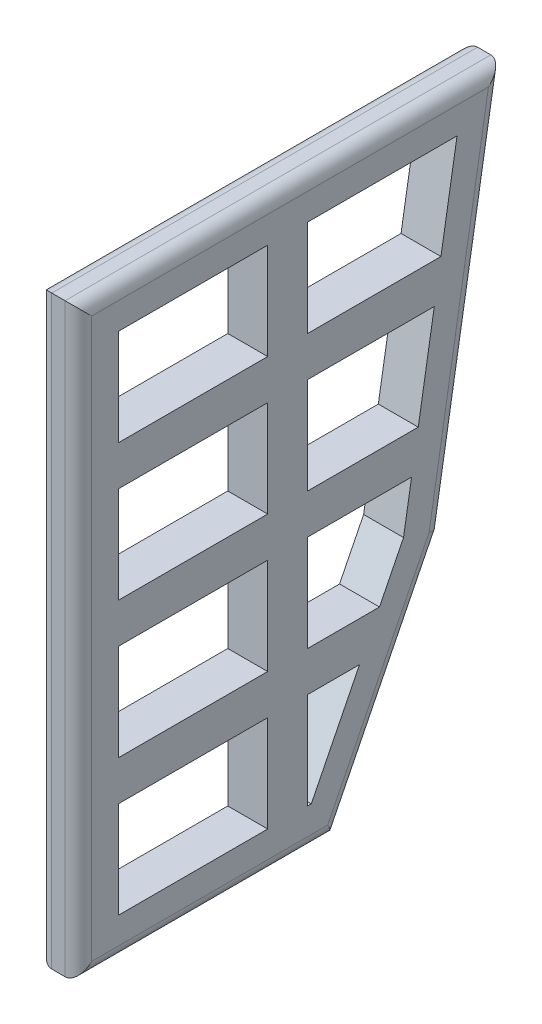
ISO-10303-21;
HEADER;
FILE_DESCRIPTION(('STEP AP214'),'2;1');
FILE_NAME('part.step','',(''),(''),'','','');
FILE_SCHEMA(('AUTOMOTIVE_DESIGN { 1 0 10303 214 1 1 1 1 }'));
ENDSEC;
DATA;
#1=APPLICATION_CONTEXT('core data for automotive mechanical design processes');
#2=APPLICATION_PROTOCOL_DEFINITION('international standard','automotive_design',2000,#1);
#3=PRODUCT_CONTEXT('',#1,'mechanical');
#4=PRODUCT('Part','Part','',(#3));
#5=PRODUCT_RELATED_PRODUCT_CATEGORY('part','',(#4));
#6=PRODUCT_DEFINITION_FORMATION('','',#4);
#7=PRODUCT_DEFINITION_CONTEXT('part definition',#1,'design');
#8=PRODUCT_DEFINITION('design','',#6,#7);
#9=PRODUCT_DEFINITION_SHAPE('','',#8);
#10=(LENGTH_UNIT() NAMED_UNIT(*) SI_UNIT(.MILLI.,.METRE.));
#11=(NAMED_UNIT(*) PLANE_ANGLE_UNIT() SI_UNIT($,.RADIAN.));
#12=(NAMED_UNIT(*) SI_UNIT($,.STERADIAN.) SOLID_ANGLE_UNIT());
#13=UNCERTAINTY_MEASURE_WITH_UNIT(LENGTH_MEASURE(1.E-05),#10,'distance_accuracy_value','');
#14=(GEOMETRIC_REPRESENTATION_CONTEXT(3) GLOBAL_UNCERTAINTY_ASSIGNED_CONTEXT((#13)) GLOBAL_UNIT_ASSIGNED_CONTEXT((#10,
#11,#12)) REPRESENTATION_CONTEXT('',''));
#15=CARTESIAN_POINT('',(0.,0.,0.));
#16=DIRECTION('',(0.,0.,1.));
#17=DIRECTION('',(1.,0.,0.));
#18=AXIS2_PLACEMENT_3D('',#15,#16,#17);
#19=CARTESIAN_POINT('',(0.,65.0875,-4.7625));
#20=DIRECTION('',(0.,0.,1.));
#21=DIRECTION('',(1.,0.,0.));
#22=AXIS2_PLACEMENT_3D('',#19,#20,#21);
#23=PLANE('',#22);
#24=DIRECTION('',(-1.,0.,0.));
#25=VECTOR('',#24,1.);
#26=CARTESIAN_POINT('',(4.7625,16.271875,-4.7625));
#27=LINE('',#26,#25);
#28=CARTESIAN_POINT('',(4.7625,16.271875,-4.7625));
#29=VERTEX_POINT('',#28);
#30=CARTESIAN_POINT('',(0.,16.271875,-4.7625));
#31=VERTEX_POINT('',#30);
#32=EDGE_CURVE('E353',#29,#31,#27,.T.);
#33=ORIENTED_EDGE('',*,*,#32,.F.);
#34=DIRECTION('',(0.,1.,0.));
#35=VECTOR('',#34,1.);
#36=CARTESIAN_POINT('',(4.7625,0.,-4.7625));
#37=LINE('',#36,#35);
#38=CARTESIAN_POINT('',(4.7625,4.7625,-4.7625));
#39=VERTEX_POINT('',#38);
#40=EDGE_CURVE('E503',#39,#29,#37,.T.);
#41=ORIENTED_EDGE('',*,*,#40,.F.);
#42=DIRECTION('',(1.,0.,0.));
#43=VECTOR('',#42,1.);
#44=CARTESIAN_POINT('',(0.,4.7625,-4.7625));
#45=LINE('',#44,#43);
#46=CARTESIAN_POINT('',(0.,4.7625,-4.7625));
#47=VERTEX_POINT('',#46);
#48=EDGE_CURVE('E495',#47,#39,#45,.T.);
#49=ORIENTED_EDGE('',*,*,#48,.F.);
#50=DIRECTION('',(0.,-1.,0.));
#51=VECTOR('',#50,1.);
#52=CARTESIAN_POINT('',(0.,65.0875,-4.7625));
#53=LINE('',#52,#51);
#54=EDGE_CURVE('E472',#31,#47,#53,.T.);
#55=ORIENTED_EDGE('',*,*,#54,.F.);
#56=EDGE_LOOP('',(#33,#41,#49,#55));
#57=FACE_BOUND('',#56,.T.);
#58=ADVANCED_FACE('F33',(#57),#23,.F.);
#59=DIRECTION('',(1.,0.,0.));
#60=VECTOR('',#59,1.);
#61=CARTESIAN_POINT('',(4.7625,21.034375,-4.7625));
#62=LINE('',#61,#60);
#63=CARTESIAN_POINT('',(0.,21.034375,-4.7625));
#64=VERTEX_POINT('',#63);
#65=CARTESIAN_POINT('',(4.7625,21.034375,-4.7625));
#66=VERTEX_POINT('',#65);
#67=EDGE_CURVE('E335',#64,#66,#62,.T.);
#68=ORIENTED_EDGE('',*,*,#67,.F.);
#69=CARTESIAN_POINT('',(0.,32.54375,-4.7625));
#70=VERTEX_POINT('',#69);
#71=EDGE_CURVE('E479',#70,#64,#53,.T.);
#72=ORIENTED_EDGE('',*,*,#71,.F.);
#73=DIRECTION('',(-1.,0.,0.));
#74=VECTOR('',#73,1.);
#75=CARTESIAN_POINT('',(4.7625,32.54375,-4.7625));
#76=LINE('',#75,#74);
#77=CARTESIAN_POINT('',(4.7625,32.54375,-4.7625));
#78=VERTEX_POINT('',#77);
#79=EDGE_CURVE('E412',#78,#70,#76,.T.);
#80=ORIENTED_EDGE('',*,*,#79,.F.);
#81=EDGE_CURVE('E507',#66,#78,#37,.T.);
#82=ORIENTED_EDGE('',*,*,#81,.F.);
#83=EDGE_LOOP('',(#68,#72,#80,#82));
#84=FACE_BOUND('',#83,.T.);
#85=ADVANCED_FACE('F675',(#84),#23,.F.);
#86=CARTESIAN_POINT('',(4.7625,-1.97269209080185,-22.5891441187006));
#87=DIRECTION('',(0.,0.,-1.));
#88=DIRECTION('',(-1.,0.,0.));
#89=AXIS2_PLACEMENT_3D('',#86,#87,#88);
#90=PLANE('',#89);
#91=DIRECTION('',(1.,0.,0.));
#92=VECTOR('',#91,1.);
#93=CARTESIAN_POINT('',(4.7625,16.271875,-22.5891441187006));
#94=LINE('',#93,#92);
#95=CARTESIAN_POINT('',(0.,16.271875,-22.5891441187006));
#96=VERTEX_POINT('',#95);
#97=CARTESIAN_POINT('',(4.7625,16.271875,-22.5891441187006));
#98=VERTEX_POINT('',#97);
#99=EDGE_CURVE('E364',#96,#98,#94,.T.);
#100=ORIENTED_EDGE('',*,*,#99,.F.);
#101=DIRECTION('',(0.,1.,0.));
#102=VECTOR('',#101,1.);
#103=CARTESIAN_POINT('',(0.,-1.97269209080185,-22.5891441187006));
#104=LINE('',#103,#102);
#105=CARTESIAN_POINT('',(0.,4.7625,-22.5891441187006));
#106=VERTEX_POINT('',#105);
#107=EDGE_CURVE('E456',#106,#96,#104,.T.);
#108=ORIENTED_EDGE('',*,*,#107,.F.);
#109=DIRECTION('',(-1.,0.,0.));
#110=VECTOR('',#109,1.);
#111=CARTESIAN_POINT('',(4.7625,4.7625,-22.5891441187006));
#112=LINE('',#111,#110);
#113=CARTESIAN_POINT('',(4.7625,4.7625,-22.5891441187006));
#114=VERTEX_POINT('',#113);
#115=EDGE_CURVE('E449',#114,#106,#112,.T.);
#116=ORIENTED_EDGE('',*,*,#115,.F.);
#117=DIRECTION('',(0.,1.,0.));
#118=VECTOR('',#117,1.);
#119=CARTESIAN_POINT('',(4.7625,-1.97269209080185,-22.5891441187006));
#120=LINE('',#119,#118);
#121=EDGE_CURVE('E448',#114,#98,#120,.T.);
#122=ORIENTED_EDGE('',*,*,#121,.T.);
#123=EDGE_LOOP('',(#100,#108,#116,#122));
#124=FACE_BOUND('',#123,.T.);
#125=ADVANCED_FACE('F682',(#124),#90,.F.);
#126=DIRECTION('',(-1.,0.,0.));
#127=VECTOR('',#126,1.);
#128=CARTESIAN_POINT('',(4.7625,21.034375,-22.5891441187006));
#129=LINE('',#128,#127);
#130=CARTESIAN_POINT('',(4.7625,21.034375,-22.5891441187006));
#131=VERTEX_POINT('',#130);
#132=CARTESIAN_POINT('',(0.,21.034375,-22.5891441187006));
#133=VERTEX_POINT('',#132);
#134=EDGE_CURVE('E59',#131,#133,#129,.T.);
#135=ORIENTED_EDGE('',*,*,#134,.F.);
#136=CARTESIAN_POINT('',(4.7625,32.54375,-22.5891441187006));
#137=VERTEX_POINT('',#136);
#138=EDGE_CURVE('E454',#131,#137,#120,.T.);
#139=ORIENTED_EDGE('',*,*,#138,.T.);
#140=DIRECTION('',(1.,0.,0.));
#141=VECTOR('',#140,1.);
#142=CARTESIAN_POINT('',(4.7625,32.54375,-22.5891441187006));
#143=LINE('',#142,#141);
#144=CARTESIAN_POINT('',(0.,32.54375,-22.5891441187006));
#145=VERTEX_POINT('',#144);
#146=EDGE_CURVE('E435',#145,#137,#143,.T.);
#147=ORIENTED_EDGE('',*,*,#146,.F.);
#148=EDGE_CURVE('E460',#133,#145,#104,.T.);
#149=ORIENTED_EDGE('',*,*,#148,.F.);
#150=EDGE_LOOP('',(#135,#139,#147,#149));
#151=FACE_BOUND('',#150,.T.);
#152=ADVANCED_FACE('F698',(#151),#90,.F.);
#153=CARTESIAN_POINT('',(4.7625,-1.97269209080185,-27.3516441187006));
#154=DIRECTION('',(0.,0.,1.));
#155=DIRECTION('',(1.,0.,0.));
#156=AXIS2_PLACEMENT_3D('',#153,#154,#155);
#157=PLANE('',#156);
#158=DIRECTION('',(-1.,0.,0.));
#159=VECTOR('',#158,1.);
#160=CARTESIAN_POINT('',(4.7625,16.271875,-27.3516441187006));
#161=LINE('',#160,#159);
#162=CARTESIAN_POINT('',(4.7625,16.271875,-27.3516441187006));
#163=VERTEX_POINT('',#162);
#164=CARTESIAN_POINT('',(0.,16.271875,-27.3516441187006));
#165=VERTEX_POINT('',#164);
#166=EDGE_CURVE('E51',#163,#165,#161,.T.);
#167=ORIENTED_EDGE('',*,*,#166,.F.);
#168=DIRECTION('',(0.,1.,0.));
#169=VECTOR('',#168,1.);
#170=CARTESIAN_POINT('',(4.7625,-1.97269209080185,-27.3516441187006));
#171=LINE('',#170,#169);
#172=CARTESIAN_POINT('',(4.7625,4.7625,-27.3516441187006));
#173=VERTEX_POINT('',#172);
#174=EDGE_CURVE('E464',#173,#163,#171,.T.);
#175=ORIENTED_EDGE('',*,*,#174,.F.);
#176=DIRECTION('',(1.,0.,0.));
#177=VECTOR('',#176,1.);
#178=CARTESIAN_POINT('',(4.7625,4.7625,-27.3516441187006));
#179=LINE('',#178,#177);
#180=CARTESIAN_POINT('',(0.,4.7625,-27.3516441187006));
#181=VERTEX_POINT('',#180);
#182=EDGE_CURVE('E442',#181,#173,#179,.T.);
#183=ORIENTED_EDGE('',*,*,#182,.F.);
#184=DIRECTION('',(0.,1.,0.));
#185=VECTOR('',#184,1.);
#186=CARTESIAN_POINT('',(0.,-1.97269209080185,-27.3516441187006));
#187=LINE('',#186,#185);
#188=EDGE_CURVE('E443',#181,#165,#187,.T.);
#189=ORIENTED_EDGE('',*,*,#188,.T.);
#190=EDGE_LOOP('',(#167,#175,#183,#189));
#191=FACE_BOUND('',#190,.T.);
#192=ADVANCED_FACE('F931',(#191),#157,.F.);
#193=DIRECTION('',(1.,0.,0.));
#194=VECTOR('',#193,1.);
#195=CARTESIAN_POINT('',(4.7625,21.034375,-27.3516441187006));
#196=LINE('',#195,#194);
#197=CARTESIAN_POINT('',(0.,21.034375,-27.3516441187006));
#198=VERTEX_POINT('',#197);
#199=CARTESIAN_POINT('',(4.7625,21.034375,-27.3516441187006));
#200=VERTEX_POINT('',#199);
#201=EDGE_CURVE('E344',#198,#200,#196,.T.);
#202=ORIENTED_EDGE('',*,*,#201,.F.);
#203=CARTESIAN_POINT('',(0.,32.54375,-27.3516441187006));
#204=VERTEX_POINT('',#203);
#205=EDGE_CURVE('E332',#198,#204,#187,.T.);
#206=ORIENTED_EDGE('',*,*,#205,.T.);
#207=DIRECTION('',(-1.,0.,0.));
#208=VECTOR('',#207,1.);
#209=CARTESIAN_POINT('',(4.7625,32.54375,-27.3516441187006));
#210=LINE('',#209,#208);
#211=CARTESIAN_POINT('',(4.7625,32.54375,-27.3516441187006));
#212=VERTEX_POINT('',#211);
#213=EDGE_CURVE('E11',#212,#204,#210,.T.);
#214=ORIENTED_EDGE('',*,*,#213,.F.);
#215=EDGE_CURVE('E467',#200,#212,#171,.T.);
#216=ORIENTED_EDGE('',*,*,#215,.F.);
#217=EDGE_LOOP('',(#202,#206,#214,#216));
#218=FACE_BOUND('',#217,.T.);
#219=ADVANCED_FACE('F939',(#218),#157,.F.);
#220=CARTESIAN_POINT('',(0.,4.7625,-27.7903230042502));
#221=DIRECTION('',(0.,-0.447134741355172,-0.894466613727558));
#222=DIRECTION('',(0.,0.894466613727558,-0.447134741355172));
#223=AXIS2_PLACEMENT_3D('',#220,#221,#222);
#224=PLANE('',#223);
#225=DIRECTION('',(-1.,0.,0.));
#226=VECTOR('',#225,1.);
#227=CARTESIAN_POINT('',(4.7625,16.271875,-33.5437422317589));
#228=LINE('',#227,#226);
#229=CARTESIAN_POINT('',(4.7625,16.271875,-33.5437422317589));
#230=VERTEX_POINT('',#229);
#231=CARTESIAN_POINT('',(0.,16.271875,-33.5437422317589));
#232=VERTEX_POINT('',#231);
#233=EDGE_CURVE('E342',#230,#232,#228,.T.);
#234=ORIENTED_EDGE('',*,*,#233,.T.);
#235=DIRECTION('',(0.,0.894466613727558,-0.447134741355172));
#236=VECTOR('',#235,1.);
#237=CARTESIAN_POINT('',(0.,4.7625,-27.7903230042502));
#238=LINE('',#237,#236);
#239=CARTESIAN_POINT('',(0.,4.7625,-27.7903230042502));
#240=VERTEX_POINT('',#239);
#241=EDGE_CURVE('E323',#240,#232,#238,.T.);
#242=ORIENTED_EDGE('',*,*,#241,.F.);
#243=DIRECTION('',(1.,0.,0.));
#244=VECTOR('',#243,1.);
#245=CARTESIAN_POINT('',(0.,4.7625,-27.7903230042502));
#246=LINE('',#245,#244);
#247=CARTESIAN_POINT('',(4.7625,4.7625,-27.7903230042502));
#248=VERTEX_POINT('',#247);
#249=EDGE_CURVE('E492',#240,#248,#246,.T.);
#250=ORIENTED_EDGE('',*,*,#249,.T.);
#251=DIRECTION('',(0.,-0.894466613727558,0.447134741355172));
#252=VECTOR('',#251,1.);
#253=CARTESIAN_POINT('',(4.7625,-10.1624949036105,-20.3294702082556));
#254=LINE('',#253,#252);
#255=EDGE_CURVE('E37',#230,#248,#254,.T.);
#256=ORIENTED_EDGE('',*,*,#255,.F.);
#257=EDGE_LOOP('',(#234,#242,#250,#256));
#258=FACE_BOUND('',#257,.T.);
#259=ADVANCED_FACE('F946',(#258),#224,.F.);
#260=DIRECTION('',(1.,0.,0.));
#261=VECTOR('',#260,1.);
#262=CARTESIAN_POINT('',(4.7625,21.034375,-35.9244674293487));
#263=LINE('',#262,#261);
#264=CARTESIAN_POINT('',(0.,21.034375,-35.9244674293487));
#265=VERTEX_POINT('',#264);
#266=CARTESIAN_POINT('',(4.7625,21.034375,-35.9244674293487));
#267=VERTEX_POINT('',#266);
#268=EDGE_CURVE('E316',#265,#267,#263,.T.);
#269=ORIENTED_EDGE('',*,*,#268,.T.);
#270=CARTESIAN_POINT('',(4.7625,26.7759606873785,-38.794627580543));
#271=VERTEX_POINT('',#270);
#272=EDGE_CURVE('E512',#271,#267,#254,.T.);
#273=ORIENTED_EDGE('',*,*,#272,.F.);
#274=DIRECTION('',(1.,0.,0.));
#275=VECTOR('',#274,1.);
#276=CARTESIAN_POINT('',(0.,26.7759606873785,-38.794627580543));
#277=LINE('',#276,#275);
#278=CARTESIAN_POINT('',(0.,26.7759606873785,-38.794627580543));
#279=VERTEX_POINT('',#278);
#280=EDGE_CURVE('E319',#279,#271,#277,.T.);
#281=ORIENTED_EDGE('',*,*,#280,.F.);
#282=EDGE_CURVE('E311',#265,#279,#238,.T.);
#283=ORIENTED_EDGE('',*,*,#282,.F.);
#284=EDGE_LOOP('',(#269,#273,#281,#283));
#285=FACE_BOUND('',#284,.T.);
#286=ADVANCED_FACE('F313',(#285),#224,.F.);
#287=CARTESIAN_POINT('',(0.,26.7759606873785,-38.794627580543));
#288=DIRECTION('',(0.,-0.164359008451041,-0.986400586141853));
#289=DIRECTION('',(0.,0.986400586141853,-0.164359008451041));
#290=AXIS2_PLACEMENT_3D('',#287,#288,#289);
#291=PLANE('',#290);
#292=DIRECTION('',(-1.,0.,0.));
#293=VECTOR('',#292,1.);
#294=CARTESIAN_POINT('',(4.76249999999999,48.815625,-42.4669868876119));
#295=LINE('',#294,#293);
#296=CARTESIAN_POINT('',(4.76249999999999,48.815625,-42.4669868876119));
#297=VERTEX_POINT('',#296);
#298=CARTESIAN_POINT('',(0.,48.815625,-42.4669868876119));
#299=VERTEX_POINT('',#298);
#300=EDGE_CURVE('E377',#297,#299,#295,.T.);
#301=ORIENTED_EDGE('',*,*,#300,.T.);
#302=DIRECTION('',(0.,0.986400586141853,-0.164359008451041));
#303=VECTOR('',#302,1.);
#304=CARTESIAN_POINT('',(0.,26.7759606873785,-38.794627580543));
#305=LINE('',#304,#303);
#306=CARTESIAN_POINT('',(0.,37.30625,-40.5492371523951));
#307=VERTEX_POINT('',#306);
#308=EDGE_CURVE('E487',#307,#299,#305,.T.);
#309=ORIENTED_EDGE('',*,*,#308,.F.);
#310=DIRECTION('',(1.,0.,0.));
#311=VECTOR('',#310,1.);
#312=CARTESIAN_POINT('',(4.7625,37.30625,-40.5492371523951));
#313=LINE('',#312,#311);
#314=CARTESIAN_POINT('',(4.7625,37.30625,-40.5492371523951));
#315=VERTEX_POINT('',#314);
#316=EDGE_CURVE('E410',#307,#315,#313,.T.);
#317=ORIENTED_EDGE('',*,*,#316,.T.);
#318=DIRECTION('',(0.,-0.986400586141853,0.164359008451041));
#319=VECTOR('',#318,1.);
#320=CARTESIAN_POINT('',(4.7625,-5.56621062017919,-33.4056129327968));
#321=LINE('',#320,#319);
#322=EDGE_CURVE('E521',#297,#315,#321,.T.);
#323=ORIENTED_EDGE('',*,*,#322,.F.);
#324=EDGE_LOOP('',(#301,#309,#317,#323));
#325=FACE_BOUND('',#324,.T.);
#326=ADVANCED_FACE('F539',(#325),#291,.F.);
#327=DIRECTION('',(1.,0.,0.));
#328=VECTOR('',#327,1.);
#329=CARTESIAN_POINT('',(4.76249999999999,53.578125,-43.2605385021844));
#330=LINE('',#329,#328);
#331=CARTESIAN_POINT('',(0.,53.578125,-43.2605385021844));
#332=VERTEX_POINT('',#331);
#333=CARTESIAN_POINT('',(4.76249999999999,53.578125,-43.2605385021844));
#334=VERTEX_POINT('',#333);
#335=EDGE_CURVE('E371',#332,#334,#330,.T.);
#336=ORIENTED_EDGE('',*,*,#335,.T.);
#337=CARTESIAN_POINT('',(4.7625,65.0875,-45.1782882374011));
#338=VERTEX_POINT('',#337);
#339=EDGE_CURVE('E516',#338,#334,#321,.T.);
#340=ORIENTED_EDGE('',*,*,#339,.F.);
#341=DIRECTION('',(1.,0.,0.));
#342=VECTOR('',#341,1.);
#343=CARTESIAN_POINT('',(0.,65.0875,-45.1782882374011));
#344=LINE('',#343,#342);
#345=CARTESIAN_POINT('',(0.,65.0875,-45.1782882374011));
#346=VERTEX_POINT('',#345);
#347=EDGE_CURVE('E488',#346,#338,#344,.T.);
#348=ORIENTED_EDGE('',*,*,#347,.F.);
#349=EDGE_CURVE('E483',#332,#346,#305,.T.);
#350=ORIENTED_EDGE('',*,*,#349,.F.);
#351=EDGE_LOOP('',(#336,#340,#348,#350));
#352=FACE_BOUND('',#351,.T.);
#353=ADVANCED_FACE('F643',(#352),#291,.F.);
#354=DIRECTION('',(-1.,0.,0.));
#355=VECTOR('',#354,1.);
#356=CARTESIAN_POINT('',(4.76249999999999,48.815625,-4.7625));
#357=LINE('',#356,#355);
#358=CARTESIAN_POINT('',(4.76249999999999,48.815625,-4.7625));
#359=VERTEX_POINT('',#358);
#360=CARTESIAN_POINT('',(0.,48.815625,-4.7625));
#361=VERTEX_POINT('',#360);
#362=EDGE_CURVE('E373',#359,#361,#357,.T.);
#363=ORIENTED_EDGE('',*,*,#362,.F.);
#364=CARTESIAN_POINT('',(4.7625,37.30625,-4.7625));
#365=VERTEX_POINT('',#364);
#366=EDGE_CURVE('E508',#365,#359,#37,.T.);
#367=ORIENTED_EDGE('',*,*,#366,.F.);
#368=DIRECTION('',(1.,0.,0.));
#369=VECTOR('',#368,1.);
#370=CARTESIAN_POINT('',(4.7625,37.30625,-4.7625));
#371=LINE('',#370,#369);
#372=CARTESIAN_POINT('',(0.,37.30625,-4.7625));
#373=VERTEX_POINT('',#372);
#374=EDGE_CURVE('E407',#373,#365,#371,.T.);
#375=ORIENTED_EDGE('',*,*,#374,.F.);
#376=EDGE_CURVE('E478',#361,#373,#53,.T.);
#377=ORIENTED_EDGE('',*,*,#376,.F.);
#378=EDGE_LOOP('',(#363,#367,#375,#377));
#379=FACE_BOUND('',#378,.T.);
#380=ADVANCED_FACE('F684',(#379),#23,.F.);
#381=DIRECTION('',(1.,0.,0.));
#382=VECTOR('',#381,1.);
#383=CARTESIAN_POINT('',(4.76249999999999,53.578125,-4.7625));
#384=LINE('',#383,#382);
#385=CARTESIAN_POINT('',(0.,53.578125,-4.7625));
#386=VERTEX_POINT('',#385);
#387=CARTESIAN_POINT('',(4.76249999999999,53.578125,-4.7625));
#388=VERTEX_POINT('',#387);
#389=EDGE_CURVE('E368',#386,#388,#384,.T.);
#390=ORIENTED_EDGE('',*,*,#389,.F.);
#391=CARTESIAN_POINT('',(0.,65.0875,-4.7625));
#392=VERTEX_POINT('',#391);
#393=EDGE_CURVE('E474',#392,#386,#53,.T.);
#394=ORIENTED_EDGE('',*,*,#393,.F.);
#395=DIRECTION('',(1.,0.,0.));
#396=VECTOR('',#395,1.);
#397=CARTESIAN_POINT('',(0.,65.0875,-4.7625));
#398=LINE('',#397,#396);
#399=CARTESIAN_POINT('',(4.7625,65.0875,-4.7625));
#400=VERTEX_POINT('',#399);
#401=EDGE_CURVE('E486',#392,#400,#398,.T.);
#402=ORIENTED_EDGE('',*,*,#401,.T.);
#403=EDGE_CURVE('E491',#388,#400,#37,.T.);
#404=ORIENTED_EDGE('',*,*,#403,.F.);
#405=EDGE_LOOP('',(#390,#394,#402,#404));
#406=FACE_BOUND('',#405,.T.);
#407=ADVANCED_FACE('F678',(#406),#23,.F.);
#408=DIRECTION('',(1.,0.,0.));
#409=VECTOR('',#408,1.);
#410=CARTESIAN_POINT('',(4.7625,48.815625,-22.5891441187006));
#411=LINE('',#410,#409);
#412=CARTESIAN_POINT('',(0.,48.815625,-22.5891441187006));
#413=VERTEX_POINT('',#412);
#414=CARTESIAN_POINT('',(4.7625,48.815625,-22.5891441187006));
#415=VERTEX_POINT('',#414);
#416=EDGE_CURVE('E403',#413,#415,#411,.T.);
#417=ORIENTED_EDGE('',*,*,#416,.F.);
#418=CARTESIAN_POINT('',(0.,37.30625,-22.5891441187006));
#419=VERTEX_POINT('',#418);
#420=EDGE_CURVE('E461',#419,#413,#104,.T.);
#421=ORIENTED_EDGE('',*,*,#420,.F.);
#422=DIRECTION('',(-1.,0.,0.));
#423=VECTOR('',#422,1.);
#424=CARTESIAN_POINT('',(4.7625,37.30625,-22.5891441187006));
#425=LINE('',#424,#423);
#426=CARTESIAN_POINT('',(4.7625,37.30625,-22.5891441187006));
#427=VERTEX_POINT('',#426);
#428=EDGE_CURVE('E419',#427,#419,#425,.T.);
#429=ORIENTED_EDGE('',*,*,#428,.F.);
#430=EDGE_CURVE('E455',#427,#415,#120,.T.);
#431=ORIENTED_EDGE('',*,*,#430,.T.);
#432=EDGE_LOOP('',(#417,#421,#429,#431));
#433=FACE_BOUND('',#432,.T.);
#434=ADVANCED_FACE('F689',(#433),#90,.F.);
#435=DIRECTION('',(-1.,0.,0.));
#436=VECTOR('',#435,1.);
#437=CARTESIAN_POINT('',(4.7625,53.578125,-22.5891441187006));
#438=LINE('',#437,#436);
#439=CARTESIAN_POINT('',(4.7625,53.578125,-22.5891441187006));
#440=VERTEX_POINT('',#439);
#441=CARTESIAN_POINT('',(0.,53.578125,-22.5891441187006));
#442=VERTEX_POINT('',#441);
#443=EDGE_CURVE('E397',#440,#442,#438,.T.);
#444=ORIENTED_EDGE('',*,*,#443,.F.);
#445=CARTESIAN_POINT('',(4.7625,65.0875,-22.5891441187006));
#446=VERTEX_POINT('',#445);
#447=EDGE_CURVE('E466',#440,#446,#120,.T.);
#448=ORIENTED_EDGE('',*,*,#447,.T.);
#449=DIRECTION('',(-1.,0.,0.));
#450=VECTOR('',#449,1.);
#451=CARTESIAN_POINT('',(4.7625,65.0875,-22.5891441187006));
#452=LINE('',#451,#450);
#453=CARTESIAN_POINT('',(0.,65.0875,-22.5891441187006));
#454=VERTEX_POINT('',#453);
#455=EDGE_CURVE('E444',#446,#454,#452,.T.);
#456=ORIENTED_EDGE('',*,*,#455,.T.);
#457=EDGE_CURVE('E447',#442,#454,#104,.T.);
#458=ORIENTED_EDGE('',*,*,#457,.F.);
#459=EDGE_LOOP('',(#444,#448,#456,#458));
#460=FACE_BOUND('',#459,.T.);
#461=ADVANCED_FACE('F695',(#460),#90,.F.);
#462=DIRECTION('',(-1.,0.,0.));
#463=VECTOR('',#462,1.);
#464=CARTESIAN_POINT('',(4.7625,48.815625,-27.3516441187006));
#465=LINE('',#464,#463);
#466=CARTESIAN_POINT('',(4.7625,48.815625,-27.3516441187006));
#467=VERTEX_POINT('',#466);
#468=CARTESIAN_POINT('',(0.,48.815625,-27.3516441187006));
#469=VERTEX_POINT('',#468);
#470=EDGE_CURVE('E400',#467,#469,#465,.T.);
#471=ORIENTED_EDGE('',*,*,#470,.F.);
#472=CARTESIAN_POINT('',(4.7625,37.30625,-27.3516441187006));
#473=VERTEX_POINT('',#472);
#474=EDGE_CURVE('E468',#473,#467,#171,.T.);
#475=ORIENTED_EDGE('',*,*,#474,.F.);
#476=DIRECTION('',(1.,0.,0.));
#477=VECTOR('',#476,1.);
#478=CARTESIAN_POINT('',(4.7625,37.30625,-27.3516441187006));
#479=LINE('',#478,#477);
#480=CARTESIAN_POINT('',(0.,37.30625,-27.3516441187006));
#481=VERTEX_POINT('',#480);
#482=EDGE_CURVE('E43',#481,#473,#479,.T.);
#483=ORIENTED_EDGE('',*,*,#482,.F.);
#484=EDGE_CURVE('E463',#481,#469,#187,.T.);
#485=ORIENTED_EDGE('',*,*,#484,.T.);
#486=EDGE_LOOP('',(#471,#475,#483,#485));
#487=FACE_BOUND('',#486,.T.);
#488=ADVANCED_FACE('F935',(#487),#157,.F.);
#489=DIRECTION('',(1.,0.,0.));
#490=VECTOR('',#489,1.);
#491=CARTESIAN_POINT('',(4.7625,53.578125,-27.3516441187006));
#492=LINE('',#491,#490);
#493=CARTESIAN_POINT('',(0.,53.578125,-27.3516441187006));
#494=VERTEX_POINT('',#493);
#495=CARTESIAN_POINT('',(4.76249999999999,53.578125,-27.3516441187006));
#496=VERTEX_POINT('',#495);
#497=EDGE_CURVE('E380',#494,#496,#492,.T.);
#498=ORIENTED_EDGE('',*,*,#497,.F.);
#499=CARTESIAN_POINT('',(0.,65.0875,-27.3516441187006));
#500=VERTEX_POINT('',#499);
#501=EDGE_CURVE('E459',#494,#500,#187,.T.);
#502=ORIENTED_EDGE('',*,*,#501,.T.);
#503=DIRECTION('',(1.,0.,0.));
#504=VECTOR('',#503,1.);
#505=CARTESIAN_POINT('',(4.7625,65.0875,-27.3516441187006));
#506=LINE('',#505,#504);
#507=CARTESIAN_POINT('',(4.7625,65.0875,-27.3516441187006));
#508=VERTEX_POINT('',#507);
#509=EDGE_CURVE('E439',#500,#508,#506,.T.);
#510=ORIENTED_EDGE('',*,*,#509,.T.);
#511=EDGE_CURVE('E438',#496,#508,#171,.T.);
#512=ORIENTED_EDGE('',*,*,#511,.F.);
#513=EDGE_LOOP('',(#498,#502,#510,#512));
#514=FACE_BOUND('',#513,.T.);
#515=ADVANCED_FACE('F653',(#514),#157,.F.);
#516=DIRECTION('',(-1.,0.,0.));
#517=VECTOR('',#516,1.);
#518=CARTESIAN_POINT('',(4.7625,32.54375,-39.7556855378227));
#519=LINE('',#518,#517);
#520=CARTESIAN_POINT('',(4.7625,32.54375,-39.7556855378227));
#521=VERTEX_POINT('',#520);
#522=CARTESIAN_POINT('',(0.,32.54375,-39.7556855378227));
#523=VERTEX_POINT('',#522);
#524=EDGE_CURVE('E417',#521,#523,#519,.T.);
#525=ORIENTED_EDGE('',*,*,#524,.T.);
#526=EDGE_CURVE('E484',#279,#523,#305,.T.);
#527=ORIENTED_EDGE('',*,*,#526,.F.);
#528=ORIENTED_EDGE('',*,*,#280,.T.);
#529=EDGE_CURVE('E513',#521,#271,#321,.T.);
#530=ORIENTED_EDGE('',*,*,#529,.F.);
#531=EDGE_LOOP('',(#525,#527,#528,#530));
#532=FACE_BOUND('',#531,.T.);
#533=ADVANCED_FACE('F943',(#532),#291,.F.);
#534=CARTESIAN_POINT('',(0.,65.0875,-45.1782882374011));
#535=DIRECTION('',(0.,1.,0.));
#536=DIRECTION('',(0.,0.,1.));
#537=AXIS2_PLACEMENT_3D('',#534,#535,#536);
#538=PLANE('',#537);
#539=ORIENTED_EDGE('',*,*,#455,.F.);
#540=DIRECTION('',(0.,0.,-1.));
#541=VECTOR('',#540,1.);
#542=CARTESIAN_POINT('',(4.7625,65.0875,0.));
#543=LINE('',#542,#541);
#544=EDGE_CURVE('E524',#400,#446,#543,.T.);
#545=ORIENTED_EDGE('',*,*,#544,.F.);
#546=ORIENTED_EDGE('',*,*,#401,.F.);
#547=DIRECTION('',(0.,0.,1.));
#548=VECTOR('',#547,1.);
#549=CARTESIAN_POINT('',(0.,65.0875,-45.1782882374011));
#550=LINE('',#549,#548);
#551=EDGE_CURVE('E473',#454,#392,#550,.T.);
#552=ORIENTED_EDGE('',*,*,#551,.F.);
#553=EDGE_LOOP('',(#539,#545,#546,#552));
#554=FACE_BOUND('',#553,.T.);
#555=ADVANCED_FACE('F710',(#554),#538,.F.);
#556=ORIENTED_EDGE('',*,*,#509,.F.);
#557=EDGE_CURVE('E469',#346,#500,#550,.T.);
#558=ORIENTED_EDGE('',*,*,#557,.F.);
#559=ORIENTED_EDGE('',*,*,#347,.T.);
#560=EDGE_CURVE('E520',#508,#338,#543,.T.);
#561=ORIENTED_EDGE('',*,*,#560,.F.);
#562=EDGE_LOOP('',(#556,#558,#559,#561));
#563=FACE_BOUND('',#562,.T.);
#564=ADVANCED_FACE('F646',(#563),#538,.F.);
#565=CARTESIAN_POINT('',(0.,4.7625,-4.7625));
#566=DIRECTION('',(0.,-1.,0.));
#567=DIRECTION('',(0.,0.,-1.));
#568=AXIS2_PLACEMENT_3D('',#565,#566,#567);
#569=PLANE('',#568);
#570=ORIENTED_EDGE('',*,*,#115,.T.);
#571=DIRECTION('',(0.,0.,-1.));
#572=VECTOR('',#571,1.);
#573=CARTESIAN_POINT('',(0.,4.7625,-4.7625));
#574=LINE('',#573,#572);
#575=EDGE_CURVE('E324',#47,#106,#574,.T.);
#576=ORIENTED_EDGE('',*,*,#575,.F.);
#577=ORIENTED_EDGE('',*,*,#48,.T.);
#578=DIRECTION('',(0.,0.,1.));
#579=VECTOR('',#578,1.);
#580=CARTESIAN_POINT('',(4.7625,4.7625,0.));
#581=LINE('',#580,#579);
#582=EDGE_CURVE('E506',#114,#39,#581,.T.);
#583=ORIENTED_EDGE('',*,*,#582,.F.);
#584=EDGE_LOOP('',(#570,#576,#577,#583));
#585=FACE_BOUND('',#584,.T.);
#586=ADVANCED_FACE('F922',(#585),#569,.F.);
#587=ORIENTED_EDGE('',*,*,#182,.T.);
#588=EDGE_CURVE('E509',#248,#173,#581,.T.);
#589=ORIENTED_EDGE('',*,*,#588,.F.);
#590=ORIENTED_EDGE('',*,*,#249,.F.);
#591=EDGE_CURVE('E477',#181,#240,#574,.T.);
#592=ORIENTED_EDGE('',*,*,#591,.F.);
#593=EDGE_LOOP('',(#587,#589,#590,#592));
#594=FACE_BOUND('',#593,.T.);
#595=ADVANCED_FACE('F771',(#594),#569,.F.);
#596=CARTESIAN_POINT('',(4.7625,0.,-30.734));
#597=DIRECTION('',(0.,1.,0.));
#598=DIRECTION('',(0.,0.,1.));
#599=AXIS2_PLACEMENT_3D('',#596,#597,#598);
#600=PLANE('',#599);
#601=DIRECTION('',(-1.,0.,0.));
#602=VECTOR('',#601,1.);
#603=CARTESIAN_POINT('',(4.7625,0.,0.));
#604=LINE('',#603,#602);
#605=CARTESIAN_POINT('',(3.175,0.,0.));
#606=VERTEX_POINT('',#605);
#607=CARTESIAN_POINT('',(1.5875,0.,0.));
#608=VERTEX_POINT('',#607);
#609=EDGE_CURVE('E628',#606,#608,#604,.T.);
#610=ORIENTED_EDGE('',*,*,#609,.T.);
#611=DIRECTION('',(0.,0.,-1.));
#612=VECTOR('',#611,1.);
#613=CARTESIAN_POINT('',(1.5875,0.,-30.734));
#614=LINE('',#613,#612);
#615=CARTESIAN_POINT('',(1.5875,0.,-30.734));
#616=VERTEX_POINT('',#615);
#617=EDGE_CURVE('E592',#608,#616,#614,.T.);
#618=ORIENTED_EDGE('',*,*,#617,.T.);
#619=DIRECTION('',(-1.,0.,0.));
#620=VECTOR('',#619,1.);
#621=CARTESIAN_POINT('',(4.7625,0.,-30.734));
#622=LINE('',#621,#620);
#623=CARTESIAN_POINT('',(3.175,0.,-30.734));
#624=VERTEX_POINT('',#623);
#625=EDGE_CURVE('E617',#624,#616,#622,.T.);
#626=ORIENTED_EDGE('',*,*,#625,.F.);
#627=DIRECTION('',(0.,0.,-1.));
#628=VECTOR('',#627,1.);
#629=CARTESIAN_POINT('',(3.175,0.,-30.734));
#630=LINE('',#629,#628);
#631=EDGE_CURVE('E594',#624,#606,#630,.F.);
#632=ORIENTED_EDGE('',*,*,#631,.T.);
#633=EDGE_LOOP('',(#610,#618,#626,#632));
#634=FACE_BOUND('',#633,.T.);
#635=ADVANCED_FACE('F767',(#634),#600,.F.);
#636=CARTESIAN_POINT('',(4.7625,25.286928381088,-43.3746777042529));
#637=DIRECTION('',(0.,0.447134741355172,0.894466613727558));
#638=DIRECTION('',(0.,-0.894466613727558,0.447134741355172));
#639=AXIS2_PLACEMENT_3D('',#636,#637,#638);
#640=PLANE('',#639);
#641=ORIENTED_EDGE('',*,*,#625,.T.);
#642=DIRECTION('',(0.,0.894466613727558,-0.447134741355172));
#643=VECTOR('',#642,1.);
#644=CARTESIAN_POINT('',(1.5875,25.286928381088,-43.3746777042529));
#645=LINE('',#644,#643);
#646=CARTESIAN_POINT('',(1.5875,25.286928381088,-43.3746777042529));
#647=VERTEX_POINT('',#646);
#648=EDGE_CURVE('E597',#616,#647,#645,.T.);
#649=ORIENTED_EDGE('',*,*,#648,.T.);
#650=DIRECTION('',(-1.,0.,0.));
#651=VECTOR('',#650,1.);
#652=CARTESIAN_POINT('',(4.7625,25.286928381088,-43.3746777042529));
#653=LINE('',#652,#651);
#654=CARTESIAN_POINT('',(3.175,25.286928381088,-43.3746777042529));
#655=VERTEX_POINT('',#654);
#656=EDGE_CURVE('E620',#655,#647,#653,.T.);
#657=ORIENTED_EDGE('',*,*,#656,.F.);
#658=DIRECTION('',(0.,0.894466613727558,-0.447134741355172));
#659=VECTOR('',#658,1.);
#660=CARTESIAN_POINT('',(3.175,25.286928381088,-43.3746777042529));
#661=LINE('',#660,#659);
#662=EDGE_CURVE('E599',#655,#624,#661,.F.);
#663=ORIENTED_EDGE('',*,*,#662,.T.);
#664=EDGE_LOOP('',(#641,#649,#657,#663));
#665=FACE_BOUND('',#664,.T.);
#666=ADVANCED_FACE('F763',(#665),#640,.F.);
#667=CARTESIAN_POINT('',(4.7625,69.85,-50.8));
#668=DIRECTION('',(0.,0.164359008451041,0.986400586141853));
#669=DIRECTION('',(0.,-0.986400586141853,0.164359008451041));
#670=AXIS2_PLACEMENT_3D('',#667,#668,#669);
#671=PLANE('',#670);
#672=ORIENTED_EDGE('',*,*,#656,.T.);
#673=DIRECTION('',(0.,0.986400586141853,-0.164359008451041));
#674=VECTOR('',#673,1.);
#675=CARTESIAN_POINT('',(1.5875,69.85,-50.8));
#676=LINE('',#675,#674);
#677=CARTESIAN_POINT('',(1.5875,69.85,-50.8));
#678=VERTEX_POINT('',#677);
#679=EDGE_CURVE('E612',#647,#678,#676,.T.);
#680=ORIENTED_EDGE('',*,*,#679,.T.);
#681=DIRECTION('',(-1.,0.,0.));
#682=VECTOR('',#681,1.);
#683=CARTESIAN_POINT('',(4.7625,69.85,-50.8));
#684=LINE('',#683,#682);
#685=CARTESIAN_POINT('',(3.175,69.85,-50.8));
#686=VERTEX_POINT('',#685);
#687=EDGE_CURVE('E623',#686,#678,#684,.T.);
#688=ORIENTED_EDGE('',*,*,#687,.F.);
#689=DIRECTION('',(0.,0.986400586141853,-0.164359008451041));
#690=VECTOR('',#689,1.);
#691=CARTESIAN_POINT('',(3.175,69.85,-50.8));
#692=LINE('',#691,#690);
#693=EDGE_CURVE('E615',#686,#655,#692,.F.);
#694=ORIENTED_EDGE('',*,*,#693,.T.);
#695=EDGE_LOOP('',(#672,#680,#688,#694));
#696=FACE_BOUND('',#695,.T.);
#697=ADVANCED_FACE('F759',(#696),#671,.F.);
#698=CARTESIAN_POINT('',(4.7625,69.85,0.));
#699=DIRECTION('',(0.,-1.,0.));
#700=DIRECTION('',(0.,0.,-1.));
#701=AXIS2_PLACEMENT_3D('',#698,#699,#700);
#702=PLANE('',#701);
#703=DIRECTION('',(-1.,0.,0.));
#704=VECTOR('',#703,1.);
#705=CARTESIAN_POINT('',(4.7625,69.85,0.));
#706=LINE('',#705,#704);
#707=CARTESIAN_POINT('',(3.175,69.85,0.));
#708=VERTEX_POINT('',#707);
#709=CARTESIAN_POINT('',(1.5875,69.85,0.));
#710=VERTEX_POINT('',#709);
#711=EDGE_CURVE('E626',#708,#710,#706,.T.);
#712=ORIENTED_EDGE('',*,*,#711,.F.);
#713=DIRECTION('',(0.,0.,1.));
#714=VECTOR('',#713,1.);
#715=CARTESIAN_POINT('',(3.175,69.85,0.));
#716=LINE('',#715,#714);
#717=EDGE_CURVE('E577',#708,#686,#716,.F.);
#718=ORIENTED_EDGE('',*,*,#717,.T.);
#719=ORIENTED_EDGE('',*,*,#687,.T.);
#720=DIRECTION('',(0.,0.,1.));
#721=VECTOR('',#720,1.);
#722=CARTESIAN_POINT('',(1.5875,69.85,0.));
#723=LINE('',#722,#721);
#724=EDGE_CURVE('E579',#678,#710,#723,.T.);
#725=ORIENTED_EDGE('',*,*,#724,.T.);
#726=EDGE_LOOP('',(#712,#718,#719,#725));
#727=FACE_BOUND('',#726,.T.);
#728=ADVANCED_FACE('F753',(#727),#702,.F.);
#729=CARTESIAN_POINT('',(4.7625,0.,0.));
#730=DIRECTION('',(0.,0.,-1.));
#731=DIRECTION('',(-1.,0.,0.));
#732=AXIS2_PLACEMENT_3D('',#729,#730,#731);
#733=PLANE('',#732);
#734=ORIENTED_EDGE('',*,*,#711,.T.);
#735=DIRECTION('',(0.,-1.,0.));
#736=VECTOR('',#735,1.);
#737=CARTESIAN_POINT('',(1.5875,0.,0.));
#738=LINE('',#737,#736);
#739=EDGE_CURVE('E547',#710,#608,#738,.T.);
#740=ORIENTED_EDGE('',*,*,#739,.T.);
#741=ORIENTED_EDGE('',*,*,#609,.F.);
#742=DIRECTION('',(0.,-1.,0.));
#743=VECTOR('',#742,1.);
#744=CARTESIAN_POINT('',(3.175,0.,0.));
#745=LINE('',#744,#743);
#746=EDGE_CURVE('E548',#606,#708,#745,.F.);
#747=ORIENTED_EDGE('',*,*,#746,.T.);
#748=EDGE_LOOP('',(#734,#740,#741,#747));
#749=FACE_BOUND('',#748,.T.);
#750=ADVANCED_FACE('F744',(#749),#733,.F.);
#751=CARTESIAN_POINT('',(4.7625,0.,0.));
#752=DIRECTION('',(-1.,0.,0.));
#753=DIRECTION('',(0.,0.,1.));
#754=AXIS2_PLACEMENT_3D('',#751,#752,#753);
#755=PLANE('',#754);
#756=ORIENTED_EDGE('',*,*,#138,.F.);
#757=DIRECTION('',(0.,0.,1.));
#758=VECTOR('',#757,1.);
#759=CARTESIAN_POINT('',(4.7625,21.034375,-41.8666217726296));
#760=LINE('',#759,#758);
#761=EDGE_CURVE('E360',#131,#66,#760,.T.);
#762=ORIENTED_EDGE('',*,*,#761,.T.);
#763=ORIENTED_EDGE('',*,*,#81,.T.);
#764=DIRECTION('',(0.,0.,1.));
#765=VECTOR('',#764,1.);
#766=CARTESIAN_POINT('',(4.7625,32.54375,-46.9340821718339));
#767=LINE('',#766,#765);
#768=EDGE_CURVE('E424',#137,#78,#767,.T.);
#769=ORIENTED_EDGE('',*,*,#768,.F.);
#770=EDGE_LOOP('',(#756,#762,#763,#769));
#771=FACE_BOUND('',#770,.T.);
#772=ORIENTED_EDGE('',*,*,#174,.T.);
#773=DIRECTION('',(0.,0.,1.));
#774=VECTOR('',#773,1.);
#775=CARTESIAN_POINT('',(4.7625,16.271875,-41.8666217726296));
#776=LINE('',#775,#774);
#777=EDGE_CURVE('E350',#230,#163,#776,.T.);
#778=ORIENTED_EDGE('',*,*,#777,.F.);
#779=ORIENTED_EDGE('',*,*,#255,.T.);
#780=ORIENTED_EDGE('',*,*,#588,.T.);
#781=EDGE_LOOP('',(#772,#778,#779,#780));
#782=FACE_BOUND('',#781,.T.);
#783=EDGE_CURVE('E341',#267,#200,#760,.T.);
#784=ORIENTED_EDGE('',*,*,#783,.T.);
#785=ORIENTED_EDGE('',*,*,#215,.T.);
#786=EDGE_CURVE('E416',#521,#212,#767,.T.);
#787=ORIENTED_EDGE('',*,*,#786,.F.);
#788=ORIENTED_EDGE('',*,*,#529,.T.);
#789=ORIENTED_EDGE('',*,*,#272,.T.);
#790=EDGE_LOOP('',(#784,#785,#787,#788,#789));
#791=FACE_BOUND('',#790,.T.);
#792=EDGE_CURVE('E354',#98,#29,#776,.T.);
#793=ORIENTED_EDGE('',*,*,#792,.F.);
#794=ORIENTED_EDGE('',*,*,#121,.F.);
#795=ORIENTED_EDGE('',*,*,#582,.T.);
#796=ORIENTED_EDGE('',*,*,#40,.T.);
#797=EDGE_LOOP('',(#793,#794,#795,#796));
#798=FACE_BOUND('',#797,.T.);
#799=DIRECTION('',(0.,-1.,0.));
#800=VECTOR('',#799,1.);
#801=CARTESIAN_POINT('',(4.7625,0.,-1.5875));
#802=LINE('',#801,#800);
#803=CARTESIAN_POINT('',(4.7625,68.2625,-1.5875));
#804=VERTEX_POINT('',#803);
#805=CARTESIAN_POINT('',(4.7625,1.5875,-1.5875));
#806=VERTEX_POINT('',#805);
#807=EDGE_CURVE('E590',#804,#806,#802,.T.);
#808=ORIENTED_EDGE('',*,*,#807,.T.);
#809=DIRECTION('',(0.,0.,-1.));
#810=VECTOR('',#809,1.);
#811=CARTESIAN_POINT('',(4.7625,1.5875,0.));
#812=LINE('',#811,#810);
#813=CARTESIAN_POINT('',(4.7625,1.5875,-29.7527743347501));
#814=VERTEX_POINT('',#813);
#815=EDGE_CURVE('E581',#806,#814,#812,.T.);
#816=ORIENTED_EDGE('',*,*,#815,.T.);
#817=DIRECTION('',(0.,0.894466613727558,-0.447134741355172));
#818=VECTOR('',#817,1.);
#819=CARTESIAN_POINT('',(4.7625,-11.5821477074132,-23.1694017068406));
#820=LINE('',#819,#818);
#821=CARTESIAN_POINT('',(4.7625,25.7832724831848,-41.8479943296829));
#822=VERTEX_POINT('',#821);
#823=EDGE_CURVE('E584',#814,#822,#820,.T.);
#824=ORIENTED_EDGE('',*,*,#823,.T.);
#825=DIRECTION('',(0.,0.986400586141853,-0.164359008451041));
#826=VECTOR('',#825,1.);
#827=CARTESIAN_POINT('',(4.7625,-6.08805047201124,-36.5374347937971));
#828=LINE('',#827,#826);
#829=CARTESIAN_POINT('',(4.7625,68.2625,-48.9260960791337));
#830=VERTEX_POINT('',#829);
#831=EDGE_CURVE('E586',#822,#830,#828,.T.);
#832=ORIENTED_EDGE('',*,*,#831,.T.);
#833=DIRECTION('',(0.,0.,1.));
#834=VECTOR('',#833,1.);
#835=CARTESIAN_POINT('',(4.7625,68.2625,0.));
#836=LINE('',#835,#834);
#837=EDGE_CURVE('E588',#830,#804,#836,.T.);
#838=ORIENTED_EDGE('',*,*,#837,.T.);
#839=EDGE_LOOP('',(#808,#816,#824,#832,#838));
#840=FACE_BOUND('',#839,.T.);
#841=DIRECTION('',(0.,0.,1.));
#842=VECTOR('',#841,1.);
#843=CARTESIAN_POINT('',(4.76249999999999,48.815625,-49.6453835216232));
#844=LINE('',#843,#842);
#845=EDGE_CURVE('E385',#415,#359,#844,.T.);
#846=ORIENTED_EDGE('',*,*,#845,.F.);
#847=ORIENTED_EDGE('',*,*,#430,.F.);
#848=DIRECTION('',(0.,0.,1.));
#849=VECTOR('',#848,1.);
#850=CARTESIAN_POINT('',(4.7625,37.30625,-46.9340821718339));
#851=LINE('',#850,#849);
#852=EDGE_CURVE('E406',#427,#365,#851,.T.);
#853=ORIENTED_EDGE('',*,*,#852,.T.);
#854=ORIENTED_EDGE('',*,*,#366,.T.);
#855=EDGE_LOOP('',(#846,#847,#853,#854));
#856=FACE_BOUND('',#855,.T.);
#857=ORIENTED_EDGE('',*,*,#474,.T.);
#858=EDGE_CURVE('E376',#297,#467,#844,.T.);
#859=ORIENTED_EDGE('',*,*,#858,.F.);
#860=ORIENTED_EDGE('',*,*,#322,.T.);
#861=EDGE_CURVE('E430',#315,#473,#851,.T.);
#862=ORIENTED_EDGE('',*,*,#861,.T.);
#863=EDGE_LOOP('',(#857,#859,#860,#862));
#864=FACE_BOUND('',#863,.T.);
#865=DIRECTION('',(0.,0.,1.));
#866=VECTOR('',#865,1.);
#867=CARTESIAN_POINT('',(4.76249999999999,53.578125,-49.6453835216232));
#868=LINE('',#867,#866);
#869=EDGE_CURVE('E392',#334,#496,#868,.T.);
#870=ORIENTED_EDGE('',*,*,#869,.T.);
#871=ORIENTED_EDGE('',*,*,#511,.T.);
#872=ORIENTED_EDGE('',*,*,#560,.T.);
#873=ORIENTED_EDGE('',*,*,#339,.T.);
#874=EDGE_LOOP('',(#870,#871,#872,#873));
#875=FACE_BOUND('',#874,.T.);
#876=ORIENTED_EDGE('',*,*,#447,.F.);
#877=EDGE_CURVE('E367',#440,#388,#868,.T.);
#878=ORIENTED_EDGE('',*,*,#877,.T.);
#879=ORIENTED_EDGE('',*,*,#403,.T.);
#880=ORIENTED_EDGE('',*,*,#544,.T.);
#881=EDGE_LOOP('',(#876,#878,#879,#880));
#882=FACE_BOUND('',#881,.T.);
#883=ADVANCED_FACE('F534',(#771,#782,#791,#798,#840,#856,#864,#875,#882),#755,.F.);
#884=CARTESIAN_POINT('',(0.,0.,0.));
#885=DIRECTION('',(-1.,0.,0.));
#886=DIRECTION('',(0.,0.,1.));
#887=AXIS2_PLACEMENT_3D('',#884,#885,#886);
#888=PLANE('',#887);
#889=ORIENTED_EDGE('',*,*,#107,.T.);
#890=DIRECTION('',(0.,0.,1.));
#891=VECTOR('',#890,1.);
#892=CARTESIAN_POINT('',(0.,16.271875,-41.8666217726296));
#893=LINE('',#892,#891);
#894=EDGE_CURVE('E357',#96,#31,#893,.T.);
#895=ORIENTED_EDGE('',*,*,#894,.T.);
#896=ORIENTED_EDGE('',*,*,#54,.T.);
#897=ORIENTED_EDGE('',*,*,#575,.T.);
#898=EDGE_LOOP('',(#889,#895,#896,#897));
#899=FACE_BOUND('',#898,.T.);
#900=ORIENTED_EDGE('',*,*,#205,.F.);
#901=DIRECTION('',(0.,0.,1.));
#902=VECTOR('',#901,1.);
#903=CARTESIAN_POINT('',(0.,21.034375,-41.8666217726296));
#904=LINE('',#903,#902);
#905=EDGE_CURVE('E328',#265,#198,#904,.T.);
#906=ORIENTED_EDGE('',*,*,#905,.F.);
#907=ORIENTED_EDGE('',*,*,#282,.T.);
#908=ORIENTED_EDGE('',*,*,#526,.T.);
#909=DIRECTION('',(0.,0.,1.));
#910=VECTOR('',#909,1.);
#911=CARTESIAN_POINT('',(0.,32.54375,-46.9340821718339));
#912=LINE('',#911,#910);
#913=EDGE_CURVE('E425',#523,#204,#912,.T.);
#914=ORIENTED_EDGE('',*,*,#913,.T.);
#915=EDGE_LOOP('',(#900,#906,#907,#908,#914));
#916=FACE_BOUND('',#915,.T.);
#917=EDGE_CURVE('E355',#232,#165,#893,.T.);
#918=ORIENTED_EDGE('',*,*,#917,.T.);
#919=ORIENTED_EDGE('',*,*,#188,.F.);
#920=ORIENTED_EDGE('',*,*,#591,.T.);
#921=ORIENTED_EDGE('',*,*,#241,.T.);
#922=EDGE_LOOP('',(#918,#919,#920,#921));
#923=FACE_BOUND('',#922,.T.);
#924=EDGE_CURVE('E336',#133,#64,#904,.T.);
#925=ORIENTED_EDGE('',*,*,#924,.F.);
#926=ORIENTED_EDGE('',*,*,#148,.T.);
#927=EDGE_CURVE('E415',#145,#70,#912,.T.);
#928=ORIENTED_EDGE('',*,*,#927,.T.);
#929=ORIENTED_EDGE('',*,*,#71,.T.);
#930=EDGE_LOOP('',(#925,#926,#928,#929));
#931=FACE_BOUND('',#930,.T.);
#932=DIRECTION('',(0.,0.,1.));
#933=VECTOR('',#932,1.);
#934=CARTESIAN_POINT('',(0.,53.578125,-49.6453835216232));
#935=LINE('',#934,#933);
#936=EDGE_CURVE('E389',#442,#386,#935,.T.);
#937=ORIENTED_EDGE('',*,*,#936,.F.);
#938=ORIENTED_EDGE('',*,*,#457,.T.);
#939=ORIENTED_EDGE('',*,*,#551,.T.);
#940=ORIENTED_EDGE('',*,*,#393,.T.);
#941=EDGE_LOOP('',(#937,#938,#939,#940));
#942=FACE_BOUND('',#941,.T.);
#943=ORIENTED_EDGE('',*,*,#501,.F.);
#944=EDGE_CURVE('E372',#332,#494,#935,.T.);
#945=ORIENTED_EDGE('',*,*,#944,.F.);
#946=ORIENTED_EDGE('',*,*,#349,.T.);
#947=ORIENTED_EDGE('',*,*,#557,.T.);
#948=EDGE_LOOP('',(#943,#945,#946,#947));
#949=FACE_BOUND('',#948,.T.);
#950=DIRECTION('',(0.,0.,1.));
#951=VECTOR('',#950,1.);
#952=CARTESIAN_POINT('',(0.,48.815625,-49.6453835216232));
#953=LINE('',#952,#951);
#954=EDGE_CURVE('E386',#299,#469,#953,.T.);
#955=ORIENTED_EDGE('',*,*,#954,.T.);
#956=ORIENTED_EDGE('',*,*,#484,.F.);
#957=DIRECTION('',(0.,0.,1.));
#958=VECTOR('',#957,1.);
#959=CARTESIAN_POINT('',(0.,37.30625,-46.9340821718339));
#960=LINE('',#959,#958);
#961=EDGE_CURVE('E411',#307,#481,#960,.T.);
#962=ORIENTED_EDGE('',*,*,#961,.F.);
#963=ORIENTED_EDGE('',*,*,#308,.T.);
#964=EDGE_LOOP('',(#955,#956,#962,#963));
#965=FACE_BOUND('',#964,.T.);
#966=ORIENTED_EDGE('',*,*,#420,.T.);
#967=EDGE_CURVE('E375',#413,#361,#953,.T.);
#968=ORIENTED_EDGE('',*,*,#967,.T.);
#969=ORIENTED_EDGE('',*,*,#376,.T.);
#970=EDGE_CURVE('E427',#419,#373,#960,.T.);
#971=ORIENTED_EDGE('',*,*,#970,.F.);
#972=EDGE_LOOP('',(#966,#968,#969,#971));
#973=FACE_BOUND('',#972,.T.);
#974=DIRECTION('',(0.,0.,1.));
#975=VECTOR('',#974,1.);
#976=CARTESIAN_POINT('',(0.,68.2625,-50.8));
#977=LINE('',#976,#975);
#978=CARTESIAN_POINT('',(0.,68.2625,-1.5875));
#979=VERTEX_POINT('',#978);
#980=CARTESIAN_POINT('',(0.,68.2625,-48.9260960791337));
#981=VERTEX_POINT('',#980);
#982=EDGE_CURVE('E608',#979,#981,#977,.F.);
#983=ORIENTED_EDGE('',*,*,#982,.T.);
#984=DIRECTION('',(0.,0.986400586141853,-0.164359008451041));
#985=VECTOR('',#984,1.);
#986=CARTESIAN_POINT('',(0.,25.547848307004,-41.8087667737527));
#987=LINE('',#986,#985);
#988=CARTESIAN_POINT('',(0.,25.7832724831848,-41.8479943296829));
#989=VERTEX_POINT('',#988);
#990=EDGE_CURVE('E601',#981,#989,#987,.F.);
#991=ORIENTED_EDGE('',*,*,#990,.T.);
#992=DIRECTION('',(0.,0.894466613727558,-0.447134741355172));
#993=VECTOR('',#992,1.);
#994=CARTESIAN_POINT('',(0.,0.709826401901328,-29.3140342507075));
#995=LINE('',#994,#993);
#996=CARTESIAN_POINT('',(0.,1.5875,-29.7527743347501));
#997=VERTEX_POINT('',#996);
#998=EDGE_CURVE('E604',#989,#997,#995,.F.);
#999=ORIENTED_EDGE('',*,*,#998,.T.);
#1000=DIRECTION('',(0.,0.,-1.));
#1001=VECTOR('',#1000,1.);
#1002=CARTESIAN_POINT('',(0.,1.5875,0.));
#1003=LINE('',#1002,#1001);
#1004=CARTESIAN_POINT('',(0.,1.5875,-1.5875));
#1005=VERTEX_POINT('',#1004);
#1006=EDGE_CURVE('E606',#997,#1005,#1003,.F.);
#1007=ORIENTED_EDGE('',*,*,#1006,.T.);
#1008=DIRECTION('',(0.,-1.,0.));
#1009=VECTOR('',#1008,1.);
#1010=CARTESIAN_POINT('',(0.,69.85,-1.5875));
#1011=LINE('',#1010,#1009);
#1012=EDGE_CURVE('E610',#1005,#979,#1011,.F.);
#1013=ORIENTED_EDGE('',*,*,#1012,.T.);
#1014=EDGE_LOOP('',(#983,#991,#999,#1007,#1013));
#1015=FACE_BOUND('',#1014,.T.);
#1016=ADVANCED_FACE('F329',(#899,#916,#923,#931,#942,#949,#965,#973,#1015),#888,.T.);
#1017=CARTESIAN_POINT('',(1.5875,1.5875,-30.734));
#1018=DIRECTION('',(0.,0.,1.));
#1019=DIRECTION('',(0.,-1.,0.));
#1020=AXIS2_PLACEMENT_3D('',#1017,#1018,#1019);
#1021=CYLINDRICAL_SURFACE('',#1020,1.5875);
#1022=CARTESIAN_POINT('',(1.5875,1.58749999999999,-29.7527743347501));
#1023=DIRECTION('',(0.,-0.525768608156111,0.850627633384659));
#1024=DIRECTION('',(0.,0.850627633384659,0.525768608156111));
#1025=AXIS2_PLACEMENT_3D('',#1022,#1023,#1024);
#1026=ELLIPSE('',#1025,1.86626902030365,1.5875);
#1027=EDGE_CURVE('E567',#616,#997,#1026,.F.);
#1028=ORIENTED_EDGE('',*,*,#1027,.F.);
#1029=ORIENTED_EDGE('',*,*,#617,.F.);
#1030=CARTESIAN_POINT('',(1.5875,1.5875,-1.5875));
#1031=DIRECTION('',(0.,0.707106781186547,0.707106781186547));
#1032=DIRECTION('',(0.,0.707106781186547,-0.707106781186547));
#1033=AXIS2_PLACEMENT_3D('',#1030,#1031,#1032);
#1034=ELLIPSE('',#1033,2.24506403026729,1.5875);
#1035=EDGE_CURVE('E564',#1005,#608,#1034,.T.);
#1036=ORIENTED_EDGE('',*,*,#1035,.F.);
#1037=ORIENTED_EDGE('',*,*,#1006,.F.);
#1038=EDGE_LOOP('',(#1028,#1029,#1036,#1037));
#1039=FACE_BOUND('',#1038,.T.);
#1040=ADVANCED_FACE('F750',(#1039),#1021,.T.);
#1041=CARTESIAN_POINT('',(1.5875,0.,-1.5875));
#1042=DIRECTION('',(0.,1.,0.));
#1043=DIRECTION('',(0.,0.,1.));
#1044=AXIS2_PLACEMENT_3D('',#1041,#1042,#1043);
#1045=CYLINDRICAL_SURFACE('',#1044,1.5875);
#1046=ORIENTED_EDGE('',*,*,#1035,.T.);
#1047=ORIENTED_EDGE('',*,*,#739,.F.);
#1048=CARTESIAN_POINT('',(1.5875,68.2625,-1.5875));
#1049=DIRECTION('',(0.,0.707106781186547,-0.707106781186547));
#1050=DIRECTION('',(0.,0.707106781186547,0.707106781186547));
#1051=AXIS2_PLACEMENT_3D('',#1048,#1049,#1050);
#1052=ELLIPSE('',#1051,2.24506403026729,1.5875);
#1053=EDGE_CURVE('E570',#979,#710,#1052,.T.);
#1054=ORIENTED_EDGE('',*,*,#1053,.F.);
#1055=ORIENTED_EDGE('',*,*,#1012,.F.);
#1056=EDGE_LOOP('',(#1046,#1047,#1054,#1055));
#1057=FACE_BOUND('',#1056,.T.);
#1058=ADVANCED_FACE('F783',(#1057),#1045,.T.);
#1059=CARTESIAN_POINT('',(1.5875,25.9967547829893,-41.9547119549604));
#1060=DIRECTION('',(0.,-0.894466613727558,0.447134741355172));
#1061=DIRECTION('',(0.,-0.447134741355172,-0.894466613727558));
#1062=AXIS2_PLACEMENT_3D('',#1059,#1060,#1061);
#1063=CYLINDRICAL_SURFACE('',#1062,1.5875);
#1064=ORIENTED_EDGE('',*,*,#1027,.T.);
#1065=ORIENTED_EDGE('',*,*,#998,.F.);
#1066=CARTESIAN_POINT('',(1.5875,25.7832724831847,-41.8479943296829));
#1067=DIRECTION('',(0.,-0.951002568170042,0.30918298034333));
#1068=DIRECTION('',(0.,0.309182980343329,0.951002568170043));
#1069=AXIS2_PLACEMENT_3D('',#1066,#1067,#1068);
#1070=ELLIPSE('',#1069,1.60534095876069,1.5875);
#1071=EDGE_CURVE('E573',#647,#989,#1070,.F.);
#1072=ORIENTED_EDGE('',*,*,#1071,.F.);
#1073=ORIENTED_EDGE('',*,*,#648,.F.);
#1074=EDGE_LOOP('',(#1064,#1065,#1072,#1073));
#1075=FACE_BOUND('',#1074,.T.);
#1076=ADVANCED_FACE('F779',(#1075),#1063,.T.);
#1077=CARTESIAN_POINT('',(1.5875,68.2625,0.));
#1078=DIRECTION('',(0.,0.,-1.));
#1079=DIRECTION('',(-1.,0.,0.));
#1080=AXIS2_PLACEMENT_3D('',#1077,#1078,#1079);
#1081=CYLINDRICAL_SURFACE('',#1080,1.5875);
#1082=ORIENTED_EDGE('',*,*,#1053,.T.);
#1083=ORIENTED_EDGE('',*,*,#724,.F.);
#1084=CARTESIAN_POINT('',(1.5875,68.2625,-48.9260960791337));
#1085=DIRECTION('',(0.,-0.763006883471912,-0.646390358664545));
#1086=DIRECTION('',(0.,0.646390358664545,-0.763006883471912));
#1087=AXIS2_PLACEMENT_3D('',#1084,#1085,#1086);
#1088=ELLIPSE('',#1087,2.45594628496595,1.5875);
#1089=EDGE_CURVE('E554',#981,#678,#1088,.T.);
#1090=ORIENTED_EDGE('',*,*,#1089,.F.);
#1091=ORIENTED_EDGE('',*,*,#982,.F.);
#1092=EDGE_LOOP('',(#1082,#1083,#1090,#1091));
#1093=FACE_BOUND('',#1092,.T.);
#1094=ADVANCED_FACE('F775',(#1093),#1081,.T.);
#1095=CARTESIAN_POINT('',(1.5875,70.110919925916,-49.2340890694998));
#1096=DIRECTION('',(0.,-0.986400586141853,0.164359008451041));
#1097=DIRECTION('',(0.,-0.164359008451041,-0.986400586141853));
#1098=AXIS2_PLACEMENT_3D('',#1095,#1096,#1097);
#1099=CYLINDRICAL_SURFACE('',#1098,1.5875);
#1100=ORIENTED_EDGE('',*,*,#1071,.T.);
#1101=ORIENTED_EDGE('',*,*,#990,.F.);
#1102=ORIENTED_EDGE('',*,*,#1089,.T.);
#1103=ORIENTED_EDGE('',*,*,#679,.F.);
#1104=EDGE_LOOP('',(#1100,#1101,#1102,#1103));
#1105=FACE_BOUND('',#1104,.T.);
#1106=ADVANCED_FACE('F772',(#1105),#1099,.T.);
#1107=CARTESIAN_POINT('',(3.175,68.2625,0.));
#1108=DIRECTION('',(0.,0.,1.));
#1109=DIRECTION('',(1.,0.,0.));
#1110=AXIS2_PLACEMENT_3D('',#1107,#1108,#1109);
#1111=CYLINDRICAL_SURFACE('',#1110,1.5875);
#1112=CARTESIAN_POINT('',(3.175,68.2625,-1.5875));
#1113=DIRECTION('',(0.,-0.707106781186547,0.707106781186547));
#1114=DIRECTION('',(0.,-0.707106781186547,-0.707106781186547));
#1115=AXIS2_PLACEMENT_3D('',#1112,#1113,#1114);
#1116=ELLIPSE('',#1115,2.24506403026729,1.5875);
#1117=EDGE_CURVE('E555',#804,#708,#1116,.T.);
#1118=ORIENTED_EDGE('',*,*,#1117,.F.);
#1119=ORIENTED_EDGE('',*,*,#837,.F.);
#1120=CARTESIAN_POINT('',(3.175,68.2625,-48.9260960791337));
#1121=DIRECTION('',(0.,0.763006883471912,0.646390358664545));
#1122=DIRECTION('',(0.,-0.646390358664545,0.763006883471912));
#1123=AXIS2_PLACEMENT_3D('',#1120,#1121,#1122);
#1124=ELLIPSE('',#1123,2.45594628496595,1.5875);
#1125=EDGE_CURVE('E551',#686,#830,#1124,.F.);
#1126=ORIENTED_EDGE('',*,*,#1125,.F.);
#1127=ORIENTED_EDGE('',*,*,#717,.F.);
#1128=EDGE_LOOP('',(#1118,#1119,#1126,#1127));
#1129=FACE_BOUND('',#1128,.T.);
#1130=ADVANCED_FACE('F35',(#1129),#1111,.T.);
#1131=CARTESIAN_POINT('',(3.175,-6.08805047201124,-36.5374347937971));
#1132=DIRECTION('',(0.,0.986400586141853,-0.164359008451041));
#1133=DIRECTION('',(0.,0.164359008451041,0.986400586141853));
#1134=AXIS2_PLACEMENT_3D('',#1131,#1132,#1133);
#1135=CYLINDRICAL_SURFACE('',#1134,1.5875);
#1136=ORIENTED_EDGE('',*,*,#1125,.T.);
#1137=ORIENTED_EDGE('',*,*,#831,.F.);
#1138=CARTESIAN_POINT('',(3.175,25.7832724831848,-41.8479943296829));
#1139=DIRECTION('',(0.,0.951002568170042,-0.30918298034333));
#1140=DIRECTION('',(0.,0.309182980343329,0.951002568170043));
#1141=AXIS2_PLACEMENT_3D('',#1138,#1139,#1140);
#1142=ELLIPSE('',#1141,1.60534095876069,1.5875);
#1143=EDGE_CURVE('E558',#655,#822,#1142,.F.);
#1144=ORIENTED_EDGE('',*,*,#1143,.F.);
#1145=ORIENTED_EDGE('',*,*,#693,.F.);
#1146=EDGE_LOOP('',(#1136,#1137,#1144,#1145));
#1147=FACE_BOUND('',#1146,.T.);
#1148=ADVANCED_FACE('F801',(#1147),#1135,.T.);
#1149=CARTESIAN_POINT('',(3.175,0.,-1.5875));
#1150=DIRECTION('',(0.,-1.,0.));
#1151=DIRECTION('',(0.,0.,-1.));
#1152=AXIS2_PLACEMENT_3D('',#1149,#1150,#1151);
#1153=CYLINDRICAL_SURFACE('',#1152,1.5875);
#1154=ORIENTED_EDGE('',*,*,#1117,.T.);
#1155=ORIENTED_EDGE('',*,*,#746,.F.);
#1156=CARTESIAN_POINT('',(3.175,1.5875,-1.5875));
#1157=DIRECTION('',(0.,-0.707106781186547,-0.707106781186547));
#1158=DIRECTION('',(0.,-0.707106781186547,0.707106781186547));
#1159=AXIS2_PLACEMENT_3D('',#1156,#1157,#1158);
#1160=ELLIPSE('',#1159,2.24506403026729,1.5875);
#1161=EDGE_CURVE('E561',#806,#606,#1160,.T.);
#1162=ORIENTED_EDGE('',*,*,#1161,.F.);
#1163=ORIENTED_EDGE('',*,*,#807,.F.);
#1164=EDGE_LOOP('',(#1154,#1155,#1162,#1163));
#1165=FACE_BOUND('',#1164,.T.);
#1166=ADVANCED_FACE('F798',(#1165),#1153,.T.);
#1167=CARTESIAN_POINT('',(3.175,-11.5821477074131,-23.1694017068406));
#1168=DIRECTION('',(0.,0.894466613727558,-0.447134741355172));
#1169=DIRECTION('',(0.,0.447134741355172,0.894466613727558));
#1170=AXIS2_PLACEMENT_3D('',#1167,#1168,#1169);
#1171=CYLINDRICAL_SURFACE('',#1170,1.5875);
#1172=ORIENTED_EDGE('',*,*,#1143,.T.);
#1173=ORIENTED_EDGE('',*,*,#823,.F.);
#1174=CARTESIAN_POINT('',(3.175,1.5875,-29.7527743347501));
#1175=DIRECTION('',(0.,0.525768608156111,-0.850627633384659));
#1176=DIRECTION('',(0.,0.850627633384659,0.525768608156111));
#1177=AXIS2_PLACEMENT_3D('',#1174,#1175,#1176);
#1178=ELLIPSE('',#1177,1.86626902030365,1.5875);
#1179=EDGE_CURVE('E451',#624,#814,#1178,.F.);
#1180=ORIENTED_EDGE('',*,*,#1179,.F.);
#1181=ORIENTED_EDGE('',*,*,#662,.F.);
#1182=EDGE_LOOP('',(#1172,#1173,#1180,#1181));
#1183=FACE_BOUND('',#1182,.T.);
#1184=ADVANCED_FACE('F794',(#1183),#1171,.T.);
#1185=CARTESIAN_POINT('',(3.175,1.5875,0.));
#1186=DIRECTION('',(0.,0.,-1.));
#1187=DIRECTION('',(0.,1.,0.));
#1188=AXIS2_PLACEMENT_3D('',#1185,#1186,#1187);
#1189=CYLINDRICAL_SURFACE('',#1188,1.5875);
#1190=ORIENTED_EDGE('',*,*,#1161,.T.);
#1191=ORIENTED_EDGE('',*,*,#631,.F.);
#1192=ORIENTED_EDGE('',*,*,#1179,.T.);
#1193=ORIENTED_EDGE('',*,*,#815,.F.);
#1194=EDGE_LOOP('',(#1190,#1191,#1192,#1193));
#1195=FACE_BOUND('',#1194,.T.);
#1196=ADVANCED_FACE('F791',(#1195),#1189,.T.);
#1197=CARTESIAN_POINT('',(4.7625,37.30625,-46.9340821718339));
#1198=DIRECTION('',(0.,-1.,0.));
#1199=DIRECTION('',(0.,0.,-1.));
#1200=AXIS2_PLACEMENT_3D('',#1197,#1198,#1199);
#1201=PLANE('',#1200);
#1202=ORIENTED_EDGE('',*,*,#961,.T.);
#1203=ORIENTED_EDGE('',*,*,#482,.T.);
#1204=ORIENTED_EDGE('',*,*,#861,.F.);
#1205=ORIENTED_EDGE('',*,*,#316,.F.);
#1206=EDGE_LOOP('',(#1202,#1203,#1204,#1205));
#1207=FACE_BOUND('',#1206,.T.);
#1208=ADVANCED_FACE('F544',(#1207),#1201,.F.);
#1209=CARTESIAN_POINT('',(4.7625,32.54375,-46.9340821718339));
#1210=DIRECTION('',(0.,1.,0.));
#1211=DIRECTION('',(0.,0.,1.));
#1212=AXIS2_PLACEMENT_3D('',#1209,#1210,#1211);
#1213=PLANE('',#1212);
#1214=ORIENTED_EDGE('',*,*,#786,.T.);
#1215=ORIENTED_EDGE('',*,*,#213,.T.);
#1216=ORIENTED_EDGE('',*,*,#913,.F.);
#1217=ORIENTED_EDGE('',*,*,#524,.F.);
#1218=EDGE_LOOP('',(#1214,#1215,#1216,#1217));
#1219=FACE_BOUND('',#1218,.T.);
#1220=ADVANCED_FACE('F961',(#1219),#1213,.F.);
#1221=ORIENTED_EDGE('',*,*,#927,.F.);
#1222=ORIENTED_EDGE('',*,*,#146,.T.);
#1223=ORIENTED_EDGE('',*,*,#768,.T.);
#1224=ORIENTED_EDGE('',*,*,#79,.T.);
#1225=EDGE_LOOP('',(#1221,#1222,#1223,#1224));
#1226=FACE_BOUND('',#1225,.T.);
#1227=ADVANCED_FACE('F668',(#1226),#1213,.F.);
#1228=ORIENTED_EDGE('',*,*,#852,.F.);
#1229=ORIENTED_EDGE('',*,*,#428,.T.);
#1230=ORIENTED_EDGE('',*,*,#970,.T.);
#1231=ORIENTED_EDGE('',*,*,#374,.T.);
#1232=EDGE_LOOP('',(#1228,#1229,#1230,#1231));
#1233=FACE_BOUND('',#1232,.T.);
#1234=ADVANCED_FACE('F658',(#1233),#1201,.F.);
#1235=CARTESIAN_POINT('',(4.76249999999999,53.578125,-49.6453835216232));
#1236=DIRECTION('',(0.,-1.,0.));
#1237=DIRECTION('',(0.,0.,-1.));
#1238=AXIS2_PLACEMENT_3D('',#1235,#1236,#1237);
#1239=PLANE('',#1238);
#1240=ORIENTED_EDGE('',*,*,#944,.T.);
#1241=ORIENTED_EDGE('',*,*,#497,.T.);
#1242=ORIENTED_EDGE('',*,*,#869,.F.);
#1243=ORIENTED_EDGE('',*,*,#335,.F.);
#1244=EDGE_LOOP('',(#1240,#1241,#1242,#1243));
#1245=FACE_BOUND('',#1244,.T.);
#1246=ADVANCED_FACE('F655',(#1245),#1239,.F.);
#1247=CARTESIAN_POINT('',(4.76249999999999,48.815625,-49.6453835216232));
#1248=DIRECTION('',(0.,1.,0.));
#1249=DIRECTION('',(0.,0.,1.));
#1250=AXIS2_PLACEMENT_3D('',#1247,#1248,#1249);
#1251=PLANE('',#1250);
#1252=ORIENTED_EDGE('',*,*,#858,.T.);
#1253=ORIENTED_EDGE('',*,*,#470,.T.);
#1254=ORIENTED_EDGE('',*,*,#954,.F.);
#1255=ORIENTED_EDGE('',*,*,#300,.F.);
#1256=EDGE_LOOP('',(#1252,#1253,#1254,#1255));
#1257=FACE_BOUND('',#1256,.T.);
#1258=ADVANCED_FACE('F657',(#1257),#1251,.F.);
#1259=ORIENTED_EDGE('',*,*,#967,.F.);
#1260=ORIENTED_EDGE('',*,*,#416,.T.);
#1261=ORIENTED_EDGE('',*,*,#845,.T.);
#1262=ORIENTED_EDGE('',*,*,#362,.T.);
#1263=EDGE_LOOP('',(#1259,#1260,#1261,#1262));
#1264=FACE_BOUND('',#1263,.T.);
#1265=ADVANCED_FACE('F665',(#1264),#1251,.F.);
#1266=ORIENTED_EDGE('',*,*,#877,.F.);
#1267=ORIENTED_EDGE('',*,*,#443,.T.);
#1268=ORIENTED_EDGE('',*,*,#936,.T.);
#1269=ORIENTED_EDGE('',*,*,#389,.T.);
#1270=EDGE_LOOP('',(#1266,#1267,#1268,#1269));
#1271=FACE_BOUND('',#1270,.T.);
#1272=ADVANCED_FACE('F660',(#1271),#1239,.F.);
#1273=CARTESIAN_POINT('',(4.7625,21.034375,-41.8666217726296));
#1274=DIRECTION('',(0.,-1.,0.));
#1275=DIRECTION('',(0.,0.,-1.));
#1276=AXIS2_PLACEMENT_3D('',#1273,#1274,#1275);
#1277=PLANE('',#1276);
#1278=ORIENTED_EDGE('',*,*,#905,.T.);
#1279=ORIENTED_EDGE('',*,*,#201,.T.);
#1280=ORIENTED_EDGE('',*,*,#783,.F.);
#1281=ORIENTED_EDGE('',*,*,#268,.F.);
#1282=EDGE_LOOP('',(#1278,#1279,#1280,#1281));
#1283=FACE_BOUND('',#1282,.T.);
#1284=ADVANCED_FACE('F339',(#1283),#1277,.F.);
#1285=CARTESIAN_POINT('',(4.7625,16.271875,-41.8666217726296));
#1286=DIRECTION('',(0.,1.,0.));
#1287=DIRECTION('',(0.,0.,1.));
#1288=AXIS2_PLACEMENT_3D('',#1285,#1286,#1287);
#1289=PLANE('',#1288);
#1290=ORIENTED_EDGE('',*,*,#777,.T.);
#1291=ORIENTED_EDGE('',*,*,#166,.T.);
#1292=ORIENTED_EDGE('',*,*,#917,.F.);
#1293=ORIENTED_EDGE('',*,*,#233,.F.);
#1294=EDGE_LOOP('',(#1290,#1291,#1292,#1293));
#1295=FACE_BOUND('',#1294,.T.);
#1296=ADVANCED_FACE('F883',(#1295),#1289,.F.);
#1297=ORIENTED_EDGE('',*,*,#894,.F.);
#1298=ORIENTED_EDGE('',*,*,#99,.T.);
#1299=ORIENTED_EDGE('',*,*,#792,.T.);
#1300=ORIENTED_EDGE('',*,*,#32,.T.);
#1301=EDGE_LOOP('',(#1297,#1298,#1299,#1300));
#1302=FACE_BOUND('',#1301,.T.);
#1303=ADVANCED_FACE('F893',(#1302),#1289,.F.);
#1304=ORIENTED_EDGE('',*,*,#761,.F.);
#1305=ORIENTED_EDGE('',*,*,#134,.T.);
#1306=ORIENTED_EDGE('',*,*,#924,.T.);
#1307=ORIENTED_EDGE('',*,*,#67,.T.);
#1308=EDGE_LOOP('',(#1304,#1305,#1306,#1307));
#1309=FACE_BOUND('',#1308,.T.);
#1310=ADVANCED_FACE('F885',(#1309),#1277,.F.);
#1311=CLOSED_SHELL('',(#58,#85,#125,#152,#192,#219,#259,#286,#326,#353,#380,#407,#434,#461,#488,
#515,#533,#555,#564,#586,#595,#635,#666,#697,#728,#750,#883,#1016,#1040,#1058,#1076,#1094,#1106,
#1130,#1148,#1166,#1184,#1196,#1208,#1220,#1227,#1234,#1246,#1258,#1265,#1272,#1284,#1296,#1303,#1310));
#1312=MANIFOLD_SOLID_BREP('B2',#1311);
#1313=ADVANCED_BREP_SHAPE_REPRESENTATION('',(#18,#1312),#14);
#1314=SHAPE_DEFINITION_REPRESENTATION(#9,#1313);
ENDSEC;
END-ISO-10303-21;
